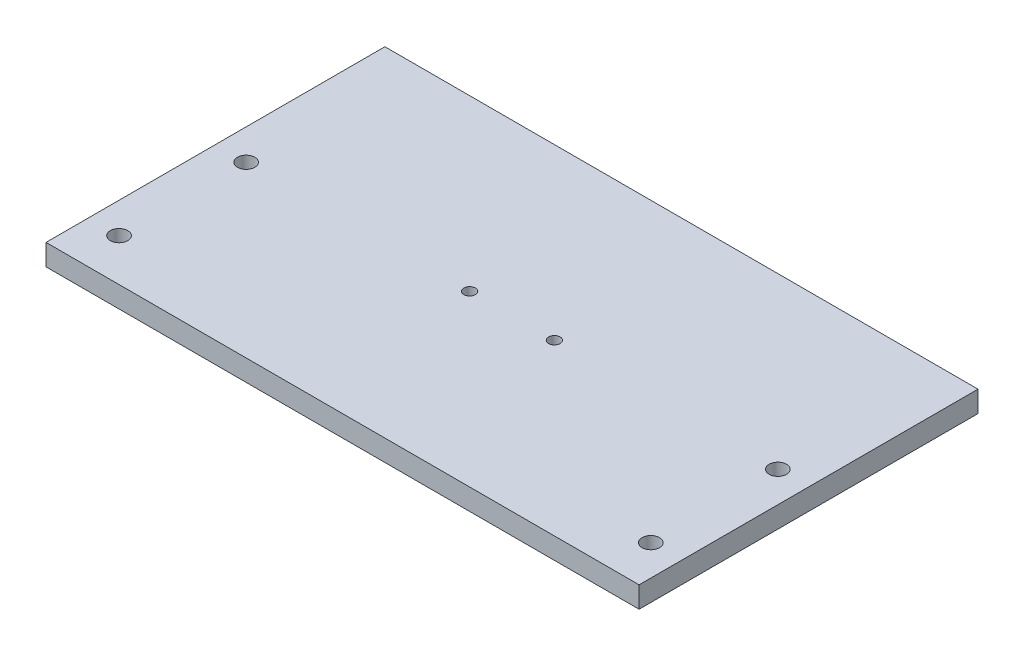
ISO-10303-21;
HEADER;
FILE_DESCRIPTION(('STEP AP214'),'2;1');
FILE_NAME('part.step','',(''),(''),'','','');
FILE_SCHEMA(('AUTOMOTIVE_DESIGN { 1 0 10303 214 1 1 1 1 }'));
ENDSEC;
DATA;
#1=APPLICATION_CONTEXT('core data for automotive mechanical design processes');
#2=APPLICATION_PROTOCOL_DEFINITION('international standard','automotive_design',2000,#1);
#3=PRODUCT_CONTEXT('',#1,'mechanical');
#4=PRODUCT('Part','Part','',(#3));
#5=PRODUCT_RELATED_PRODUCT_CATEGORY('part','',(#4));
#6=PRODUCT_DEFINITION_FORMATION('','',#4);
#7=PRODUCT_DEFINITION_CONTEXT('part definition',#1,'design');
#8=PRODUCT_DEFINITION('design','',#6,#7);
#9=PRODUCT_DEFINITION_SHAPE('','',#8);
#10=(LENGTH_UNIT() NAMED_UNIT(*) SI_UNIT(.MILLI.,.METRE.));
#11=(NAMED_UNIT(*) PLANE_ANGLE_UNIT() SI_UNIT($,.RADIAN.));
#12=(NAMED_UNIT(*) SI_UNIT($,.STERADIAN.) SOLID_ANGLE_UNIT());
#13=UNCERTAINTY_MEASURE_WITH_UNIT(LENGTH_MEASURE(1.E-05),#10,'distance_accuracy_value','');
#14=(GEOMETRIC_REPRESENTATION_CONTEXT(3) GLOBAL_UNCERTAINTY_ASSIGNED_CONTEXT((#13)) GLOBAL_UNIT_ASSIGNED_CONTEXT((#10,
#11,#12)) REPRESENTATION_CONTEXT('',''));
#15=CARTESIAN_POINT('',(0.,0.,0.));
#16=DIRECTION('',(0.,0.,1.));
#17=DIRECTION('',(1.,0.,0.));
#18=AXIS2_PLACEMENT_3D('',#15,#16,#17);
#19=CARTESIAN_POINT('',(279.598244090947,0.,0.));
#20=DIRECTION('',(0.,0.,-1.));
#21=DIRECTION('',(0.,1.,0.));
#22=AXIS2_PLACEMENT_3D('',#19,#20,#21);
#23=PLANE('',#22);
#24=DIRECTION('',(0.,-1.,0.));
#25=VECTOR('',#24,1.);
#26=CARTESIAN_POINT('',(177.8,0.,0.));
#27=LINE('',#26,#25);
#28=CARTESIAN_POINT('',(177.8,0.,0.));
#29=VERTEX_POINT('',#28);
#30=CARTESIAN_POINT('',(177.8,-6.35,0.));
#31=VERTEX_POINT('',#30);
#32=EDGE_CURVE('E85',#29,#31,#27,.T.);
#33=ORIENTED_EDGE('',*,*,#32,.F.);
#34=DIRECTION('',(-1.,0.,0.));
#35=VECTOR('',#34,1.);
#36=CARTESIAN_POINT('',(279.598244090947,0.,0.));
#37=LINE('',#36,#35);
#38=CARTESIAN_POINT('',(0.,0.,0.));
#39=VERTEX_POINT('',#38);
#40=EDGE_CURVE('E39',#29,#39,#37,.T.);
#41=ORIENTED_EDGE('',*,*,#40,.T.);
#42=DIRECTION('',(0.,-1.,0.));
#43=VECTOR('',#42,1.);
#44=CARTESIAN_POINT('',(0.,0.,0.));
#45=LINE('',#44,#43);
#46=CARTESIAN_POINT('',(0.,-6.35,0.));
#47=VERTEX_POINT('',#46);
#48=EDGE_CURVE('E83',#39,#47,#45,.T.);
#49=ORIENTED_EDGE('',*,*,#48,.T.);
#50=DIRECTION('',(-1.,0.,0.));
#51=VECTOR('',#50,1.);
#52=CARTESIAN_POINT('',(279.598244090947,-6.35,0.));
#53=LINE('',#52,#51);
#54=EDGE_CURVE('E74',#31,#47,#53,.T.);
#55=ORIENTED_EDGE('',*,*,#54,.F.);
#56=EDGE_LOOP('',(#33,#41,#49,#55));
#57=FACE_BOUND('',#56,.T.);
#58=ADVANCED_FACE('F35',(#57),#23,.F.);
#59=CARTESIAN_POINT('',(279.598244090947,-6.35,0.));
#60=DIRECTION('',(0.,1.,0.));
#61=DIRECTION('',(0.,0.,1.));
#62=AXIS2_PLACEMENT_3D('',#59,#60,#61);
#63=PLANE('',#62);
#64=CARTESIAN_POINT('',(9.1948,-6.35,-50.8));
#65=DIRECTION('',(0.,1.,0.));
#66=DIRECTION('',(0.,0.,1.));
#67=AXIS2_PLACEMENT_3D('',#64,#65,#66);
#68=CIRCLE('',#67,2.6162);
#69=CARTESIAN_POINT('',(9.1948,-6.35,-48.1838));
#70=VERTEX_POINT('',#69);
#71=EDGE_CURVE('E136',#70,#70,#68,.T.);
#72=ORIENTED_EDGE('',*,*,#71,.T.);
#73=EDGE_LOOP('',(#72));
#74=FACE_BOUND('',#73,.T.);
#75=CARTESIAN_POINT('',(9.1948,-6.35,-12.7));
#76=DIRECTION('',(0.,1.,0.));
#77=DIRECTION('',(0.,0.,1.));
#78=AXIS2_PLACEMENT_3D('',#75,#76,#77);
#79=CIRCLE('',#78,2.6162);
#80=CARTESIAN_POINT('',(9.1948,-6.35,-10.0838));
#81=VERTEX_POINT('',#80);
#82=EDGE_CURVE('E130',#81,#81,#79,.T.);
#83=ORIENTED_EDGE('',*,*,#82,.T.);
#84=EDGE_LOOP('',(#83));
#85=FACE_BOUND('',#84,.T.);
#86=CARTESIAN_POINT('',(168.6052,-6.35,-12.7));
#87=DIRECTION('',(0.,1.,0.));
#88=DIRECTION('',(0.,0.,1.));
#89=AXIS2_PLACEMENT_3D('',#86,#87,#88);
#90=CIRCLE('',#89,2.61620000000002);
#91=CARTESIAN_POINT('',(168.6052,-6.35,-10.0838));
#92=VERTEX_POINT('',#91);
#93=EDGE_CURVE('E124',#92,#92,#90,.T.);
#94=ORIENTED_EDGE('',*,*,#93,.T.);
#95=EDGE_LOOP('',(#94));
#96=FACE_BOUND('',#95,.T.);
#97=CARTESIAN_POINT('',(168.6052,-6.35,-50.8));
#98=DIRECTION('',(0.,1.,0.));
#99=DIRECTION('',(0.,0.,1.));
#100=AXIS2_PLACEMENT_3D('',#97,#98,#99);
#101=CIRCLE('',#100,2.61620000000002);
#102=CARTESIAN_POINT('',(168.6052,-6.35,-48.1838));
#103=VERTEX_POINT('',#102);
#104=EDGE_CURVE('E118',#103,#103,#101,.T.);
#105=ORIENTED_EDGE('',*,*,#104,.T.);
#106=EDGE_LOOP('',(#105));
#107=FACE_BOUND('',#106,.T.);
#108=CARTESIAN_POINT('',(101.6,-6.35,-50.8));
#109=DIRECTION('',(0.,1.,0.));
#110=DIRECTION('',(0.,0.,1.));
#111=AXIS2_PLACEMENT_3D('',#108,#109,#110);
#112=CIRCLE('',#111,1.72719999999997);
#113=CARTESIAN_POINT('',(101.6,-6.35,-49.0728));
#114=VERTEX_POINT('',#113);
#115=EDGE_CURVE('E112',#114,#114,#112,.T.);
#116=ORIENTED_EDGE('',*,*,#115,.T.);
#117=EDGE_LOOP('',(#116));
#118=FACE_BOUND('',#117,.T.);
#119=CARTESIAN_POINT('',(76.2,-6.35,-50.8));
#120=DIRECTION('',(0.,1.,0.));
#121=DIRECTION('',(0.,0.,1.));
#122=AXIS2_PLACEMENT_3D('',#119,#120,#121);
#123=CIRCLE('',#122,1.72719999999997);
#124=CARTESIAN_POINT('',(76.2,-6.35,-49.0728));
#125=VERTEX_POINT('',#124);
#126=EDGE_CURVE('E87',#125,#125,#123,.T.);
#127=ORIENTED_EDGE('',*,*,#126,.T.);
#128=EDGE_LOOP('',(#127));
#129=FACE_BOUND('',#128,.T.);
#130=DIRECTION('',(0.,0.,-1.));
#131=VECTOR('',#130,1.);
#132=CARTESIAN_POINT('',(177.8,-6.35,0.));
#133=LINE('',#132,#131);
#134=CARTESIAN_POINT('',(177.8,-6.35,-101.6));
#135=VERTEX_POINT('',#134);
#136=EDGE_CURVE('E44',#31,#135,#133,.T.);
#137=ORIENTED_EDGE('',*,*,#136,.F.);
#138=ORIENTED_EDGE('',*,*,#54,.T.);
#139=DIRECTION('',(0.,0.,-1.));
#140=VECTOR('',#139,1.);
#141=CARTESIAN_POINT('',(0.,-6.35,0.));
#142=LINE('',#141,#140);
#143=CARTESIAN_POINT('',(0.,-6.35,-101.6));
#144=VERTEX_POINT('',#143);
#145=EDGE_CURVE('E96',#47,#144,#142,.T.);
#146=ORIENTED_EDGE('',*,*,#145,.T.);
#147=DIRECTION('',(-1.,0.,0.));
#148=VECTOR('',#147,1.);
#149=CARTESIAN_POINT('',(279.598244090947,-6.35,-101.6));
#150=LINE('',#149,#148);
#151=EDGE_CURVE('E105',#135,#144,#150,.T.);
#152=ORIENTED_EDGE('',*,*,#151,.F.);
#153=EDGE_LOOP('',(#137,#138,#146,#152));
#154=FACE_BOUND('',#153,.T.);
#155=ADVANCED_FACE('F145',(#74,#85,#96,#107,#118,#129,#154),#63,.F.);
#156=CARTESIAN_POINT('',(279.598244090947,0.,-101.6));
#157=DIRECTION('',(0.,0.,1.));
#158=DIRECTION('',(1.,0.,0.));
#159=AXIS2_PLACEMENT_3D('',#156,#157,#158);
#160=PLANE('',#159);
#161=DIRECTION('',(0.,1.,0.));
#162=VECTOR('',#161,1.);
#163=CARTESIAN_POINT('',(177.8,0.,-101.6));
#164=LINE('',#163,#162);
#165=CARTESIAN_POINT('',(177.8,0.,-101.6));
#166=VERTEX_POINT('',#165);
#167=EDGE_CURVE('E11',#135,#166,#164,.T.);
#168=ORIENTED_EDGE('',*,*,#167,.F.);
#169=ORIENTED_EDGE('',*,*,#151,.T.);
#170=DIRECTION('',(0.,1.,0.));
#171=VECTOR('',#170,1.);
#172=CARTESIAN_POINT('',(0.,0.,-101.6));
#173=LINE('',#172,#171);
#174=CARTESIAN_POINT('',(0.,0.,-101.6));
#175=VERTEX_POINT('',#174);
#176=EDGE_CURVE('E106',#144,#175,#173,.T.);
#177=ORIENTED_EDGE('',*,*,#176,.T.);
#178=DIRECTION('',(-1.,0.,0.));
#179=VECTOR('',#178,1.);
#180=CARTESIAN_POINT('',(279.598244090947,0.,-101.6));
#181=LINE('',#180,#179);
#182=EDGE_CURVE('E57',#166,#175,#181,.T.);
#183=ORIENTED_EDGE('',*,*,#182,.F.);
#184=EDGE_LOOP('',(#168,#169,#177,#183));
#185=FACE_BOUND('',#184,.T.);
#186=ADVANCED_FACE('F157',(#185),#160,.F.);
#187=CARTESIAN_POINT('',(279.598244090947,0.,0.));
#188=DIRECTION('',(0.,-1.,0.));
#189=DIRECTION('',(0.,0.,-1.));
#190=AXIS2_PLACEMENT_3D('',#187,#188,#189);
#191=PLANE('',#190);
#192=CARTESIAN_POINT('',(9.1948,0.,-50.8));
#193=DIRECTION('',(0.,1.,0.));
#194=DIRECTION('',(0.,0.,1.));
#195=AXIS2_PLACEMENT_3D('',#192,#193,#194);
#196=CIRCLE('',#195,2.6162);
#197=CARTESIAN_POINT('',(9.1948,0.,-48.1838));
#198=VERTEX_POINT('',#197);
#199=EDGE_CURVE('E139',#198,#198,#196,.T.);
#200=ORIENTED_EDGE('',*,*,#199,.F.);
#201=EDGE_LOOP('',(#200));
#202=FACE_BOUND('',#201,.T.);
#203=CARTESIAN_POINT('',(9.1948,0.,-12.7));
#204=DIRECTION('',(0.,1.,0.));
#205=DIRECTION('',(0.,0.,1.));
#206=AXIS2_PLACEMENT_3D('',#203,#204,#205);
#207=CIRCLE('',#206,2.6162);
#208=CARTESIAN_POINT('',(9.1948,0.,-10.0838));
#209=VERTEX_POINT('',#208);
#210=EDGE_CURVE('E133',#209,#209,#207,.T.);
#211=ORIENTED_EDGE('',*,*,#210,.F.);
#212=EDGE_LOOP('',(#211));
#213=FACE_BOUND('',#212,.T.);
#214=CARTESIAN_POINT('',(168.6052,0.,-12.7));
#215=DIRECTION('',(0.,1.,0.));
#216=DIRECTION('',(0.,0.,1.));
#217=AXIS2_PLACEMENT_3D('',#214,#215,#216);
#218=CIRCLE('',#217,2.61620000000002);
#219=CARTESIAN_POINT('',(168.6052,0.,-10.0838));
#220=VERTEX_POINT('',#219);
#221=EDGE_CURVE('E127',#220,#220,#218,.T.);
#222=ORIENTED_EDGE('',*,*,#221,.F.);
#223=EDGE_LOOP('',(#222));
#224=FACE_BOUND('',#223,.T.);
#225=CARTESIAN_POINT('',(168.6052,0.,-50.8));
#226=DIRECTION('',(0.,1.,0.));
#227=DIRECTION('',(0.,0.,1.));
#228=AXIS2_PLACEMENT_3D('',#225,#226,#227);
#229=CIRCLE('',#228,2.61620000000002);
#230=CARTESIAN_POINT('',(168.6052,0.,-48.1838));
#231=VERTEX_POINT('',#230);
#232=EDGE_CURVE('E121',#231,#231,#229,.T.);
#233=ORIENTED_EDGE('',*,*,#232,.F.);
#234=EDGE_LOOP('',(#233));
#235=FACE_BOUND('',#234,.T.);
#236=CARTESIAN_POINT('',(101.6,0.,-50.8));
#237=DIRECTION('',(0.,1.,0.));
#238=DIRECTION('',(0.,0.,1.));
#239=AXIS2_PLACEMENT_3D('',#236,#237,#238);
#240=CIRCLE('',#239,1.72719999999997);
#241=CARTESIAN_POINT('',(101.6,0.,-49.0728));
#242=VERTEX_POINT('',#241);
#243=EDGE_CURVE('E115',#242,#242,#240,.T.);
#244=ORIENTED_EDGE('',*,*,#243,.F.);
#245=EDGE_LOOP('',(#244));
#246=FACE_BOUND('',#245,.T.);
#247=CARTESIAN_POINT('',(76.2,0.,-50.8));
#248=DIRECTION('',(0.,1.,0.));
#249=DIRECTION('',(0.,0.,1.));
#250=AXIS2_PLACEMENT_3D('',#247,#248,#249);
#251=CIRCLE('',#250,1.72719999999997);
#252=CARTESIAN_POINT('',(76.2,0.,-49.0728));
#253=VERTEX_POINT('',#252);
#254=EDGE_CURVE('E109',#253,#253,#251,.T.);
#255=ORIENTED_EDGE('',*,*,#254,.F.);
#256=EDGE_LOOP('',(#255));
#257=FACE_BOUND('',#256,.T.);
#258=DIRECTION('',(0.,0.,1.));
#259=VECTOR('',#258,1.);
#260=CARTESIAN_POINT('',(177.8,0.,0.));
#261=LINE('',#260,#259);
#262=EDGE_CURVE('E93',#166,#29,#261,.T.);
#263=ORIENTED_EDGE('',*,*,#262,.F.);
#264=ORIENTED_EDGE('',*,*,#182,.T.);
#265=DIRECTION('',(0.,0.,1.));
#266=VECTOR('',#265,1.);
#267=CARTESIAN_POINT('',(0.,0.,0.));
#268=LINE('',#267,#266);
#269=EDGE_CURVE('E89',#175,#39,#268,.T.);
#270=ORIENTED_EDGE('',*,*,#269,.T.);
#271=ORIENTED_EDGE('',*,*,#40,.F.);
#272=EDGE_LOOP('',(#263,#264,#270,#271));
#273=FACE_BOUND('',#272,.T.);
#274=ADVANCED_FACE('F90',(#202,#213,#224,#235,#246,#257,#273),#191,.F.);
#275=CARTESIAN_POINT('',(0.,-6.35,0.));
#276=DIRECTION('',(1.,0.,0.));
#277=DIRECTION('',(0.,0.,-1.));
#278=AXIS2_PLACEMENT_3D('',#275,#276,#277);
#279=PLANE('',#278);
#280=ORIENTED_EDGE('',*,*,#48,.F.);
#281=ORIENTED_EDGE('',*,*,#269,.F.);
#282=ORIENTED_EDGE('',*,*,#176,.F.);
#283=ORIENTED_EDGE('',*,*,#145,.F.);
#284=EDGE_LOOP('',(#280,#281,#282,#283));
#285=FACE_BOUND('',#284,.T.);
#286=ADVANCED_FACE('F95',(#285),#279,.F.);
#287=CARTESIAN_POINT('',(177.8,-19.0499999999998,-152.4));
#288=DIRECTION('',(1.,0.,0.));
#289=DIRECTION('',(0.,-1.,0.));
#290=AXIS2_PLACEMENT_3D('',#287,#288,#289);
#291=PLANE('',#290);
#292=ORIENTED_EDGE('',*,*,#262,.T.);
#293=ORIENTED_EDGE('',*,*,#32,.T.);
#294=ORIENTED_EDGE('',*,*,#136,.T.);
#295=ORIENTED_EDGE('',*,*,#167,.T.);
#296=EDGE_LOOP('',(#292,#293,#294,#295));
#297=FACE_BOUND('',#296,.T.);
#298=ADVANCED_FACE('F37',(#297),#291,.T.);
#299=CARTESIAN_POINT('',(76.2,-6.35,-50.8));
#300=DIRECTION('',(0.,1.,0.));
#301=DIRECTION('',(0.,0.,1.));
#302=AXIS2_PLACEMENT_3D('',#299,#300,#301);
#303=CYLINDRICAL_SURFACE('',#302,1.72719999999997);
#304=ORIENTED_EDGE('',*,*,#126,.F.);
#305=EDGE_LOOP('',(#304));
#306=FACE_BOUND('',#305,.T.);
#307=ORIENTED_EDGE('',*,*,#254,.T.);
#308=EDGE_LOOP('',(#307));
#309=FACE_BOUND('',#308,.T.);
#310=ADVANCED_FACE('F169',(#306,#309),#303,.F.);
#311=CARTESIAN_POINT('',(101.6,-6.35,-50.8));
#312=DIRECTION('',(0.,1.,0.));
#313=DIRECTION('',(0.,0.,1.));
#314=AXIS2_PLACEMENT_3D('',#311,#312,#313);
#315=CYLINDRICAL_SURFACE('',#314,1.72719999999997);
#316=ORIENTED_EDGE('',*,*,#115,.F.);
#317=EDGE_LOOP('',(#316));
#318=FACE_BOUND('',#317,.T.);
#319=ORIENTED_EDGE('',*,*,#243,.T.);
#320=EDGE_LOOP('',(#319));
#321=FACE_BOUND('',#320,.T.);
#322=ADVANCED_FACE('F171',(#318,#321),#315,.F.);
#323=CARTESIAN_POINT('',(168.6052,-6.35,-50.8));
#324=DIRECTION('',(0.,1.,0.));
#325=DIRECTION('',(0.,0.,1.));
#326=AXIS2_PLACEMENT_3D('',#323,#324,#325);
#327=CYLINDRICAL_SURFACE('',#326,2.61620000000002);
#328=ORIENTED_EDGE('',*,*,#104,.F.);
#329=EDGE_LOOP('',(#328));
#330=FACE_BOUND('',#329,.T.);
#331=ORIENTED_EDGE('',*,*,#232,.T.);
#332=EDGE_LOOP('',(#331));
#333=FACE_BOUND('',#332,.T.);
#334=ADVANCED_FACE('F178',(#330,#333),#327,.F.);
#335=CARTESIAN_POINT('',(168.6052,-6.35,-12.7));
#336=DIRECTION('',(0.,1.,0.));
#337=DIRECTION('',(0.,0.,1.));
#338=AXIS2_PLACEMENT_3D('',#335,#336,#337);
#339=CYLINDRICAL_SURFACE('',#338,2.61620000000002);
#340=ORIENTED_EDGE('',*,*,#93,.F.);
#341=EDGE_LOOP('',(#340));
#342=FACE_BOUND('',#341,.T.);
#343=ORIENTED_EDGE('',*,*,#221,.T.);
#344=EDGE_LOOP('',(#343));
#345=FACE_BOUND('',#344,.T.);
#346=ADVANCED_FACE('F232',(#342,#345),#339,.F.);
#347=CARTESIAN_POINT('',(9.1948,-6.35,-12.7));
#348=DIRECTION('',(0.,1.,0.));
#349=DIRECTION('',(0.,0.,1.));
#350=AXIS2_PLACEMENT_3D('',#347,#348,#349);
#351=CYLINDRICAL_SURFACE('',#350,2.6162);
#352=ORIENTED_EDGE('',*,*,#82,.F.);
#353=EDGE_LOOP('',(#352));
#354=FACE_BOUND('',#353,.T.);
#355=ORIENTED_EDGE('',*,*,#210,.T.);
#356=EDGE_LOOP('',(#355));
#357=FACE_BOUND('',#356,.T.);
#358=ADVANCED_FACE('F151',(#354,#357),#351,.F.);
#359=CARTESIAN_POINT('',(9.1948,-6.35,-50.8));
#360=DIRECTION('',(0.,1.,0.));
#361=DIRECTION('',(0.,0.,1.));
#362=AXIS2_PLACEMENT_3D('',#359,#360,#361);
#363=CYLINDRICAL_SURFACE('',#362,2.6162);
#364=ORIENTED_EDGE('',*,*,#71,.F.);
#365=EDGE_LOOP('',(#364));
#366=FACE_BOUND('',#365,.T.);
#367=ORIENTED_EDGE('',*,*,#199,.T.);
#368=EDGE_LOOP('',(#367));
#369=FACE_BOUND('',#368,.T.);
#370=ADVANCED_FACE('F148',(#366,#369),#363,.F.);
#371=CLOSED_SHELL('',(#58,#155,#186,#274,#286,#298,#310,#322,#334,#346,#358,#370));
#372=MANIFOLD_SOLID_BREP('B2',#371);
#373=ADVANCED_BREP_SHAPE_REPRESENTATION('',(#18,#372),#14);
#374=SHAPE_DEFINITION_REPRESENTATION(#9,#373);
ENDSEC;
END-ISO-10303-21;
